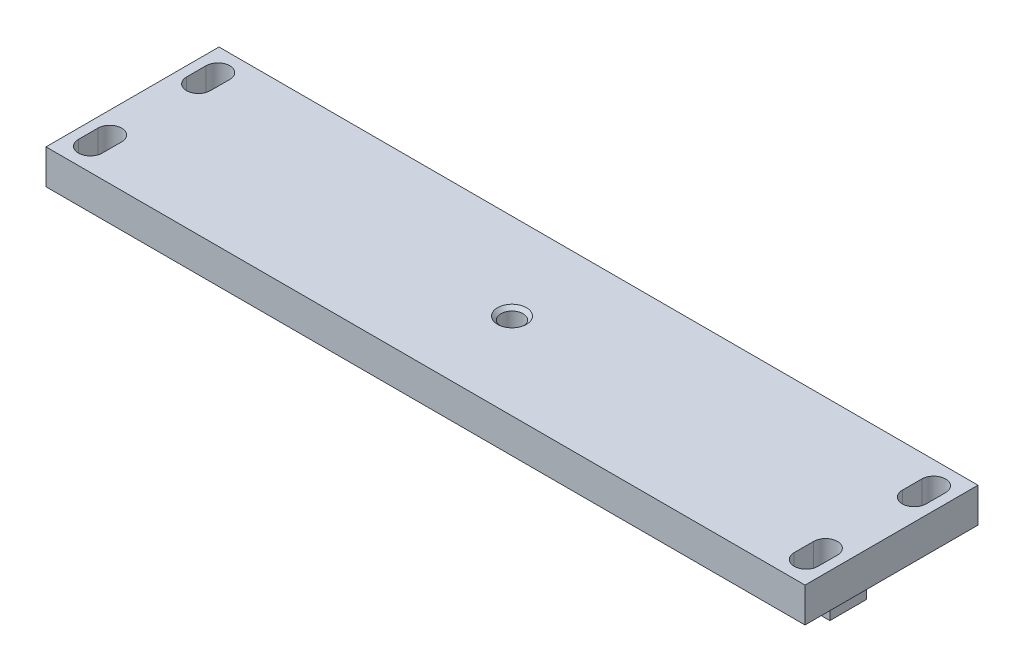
from build123d import *

# Parameters (mm, degrees)
EXTRUDE_1_DEPTH        = 351
CUT_EXTRUDE_1_DEPTH    = 356.688417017
CUT_EXTRUDE_2_DEPTH    = 364.056469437
SKETCH_4_R             = 5
CUT_EXTRUDE_3_DEPTH    = 356.688417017
HOLE_WIZARD_M121_D     = 10.2
HOLE_WIZARD_M121_DEPTH = 27
HOLE_WIZARD_M121_TIP   = 3.064389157
CHAMFER_1_SIZE         = 1.6
HOLE_WIZARD_M101_D     = 8.5
HOLE_WIZARD_M101_DEPTH = 26
HOLE_WIZARD_M101_TIP   = 2.553657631
CHAMFER_2_SIZE         = 1.5
HOLE_WIZARD_M102_D     = 8.5
HOLE_WIZARD_M102_DEPTH = 26
HOLE_WIZARD_M102_TIP   = 2.553657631
CHAMFER_3_SIZE         = 1.5
CHAMFER_4_SIZE         = 1


with BuildPart() as part:
    # Sketch 1 → Extrude 1 (new body)
    with BuildSketch(Plane(origin=(0, 0, 0), x_dir=(0, 0, -1), z_dir=(1, 0, 0))):
        Polygon((0, 0), (0, 16), (80, 16), (80, 0), (48.5, 0), (48.5, -31), (31.5, -31), (31.5, 0), align=None)
    extrude(amount=EXTRUDE_1_DEPTH)

    # Sketch 2 → Cut-Extrude 1 (cut, through all)
    with BuildSketch(Plane.XY.offset(-31.5)):
        Polygon((351, 0), (331, 0), (331, -24), (251, -24), (251, -31), (351, -31), align=None)
        Polygon((0, -31), (0, 0), (20, 0), (20, -24), (101, -24), (101, -31), align=None)
    extrude(amount=-CUT_EXTRUDE_1_DEPTH, mode=Mode.SUBTRACT)

    # Sketch 3 → Cut-Extrude 2 (cut, through all)
    with BuildSketch(Plane(origin=(0, 16, 0), x_dir=(1, 0, 0), z_dir=(0, 1, 0))):
        with BuildLine():
            Line((15.5, 69.5), (15.5, 60.5))
            ThreePointArc((15.5, 60.5), (10, 55), (4.5, 60.5))
            Line((4.5, 60.5), (4.5, 69.5))
            ThreePointArc((4.5, 69.5), (10, 75), (15.5, 69.5))
        make_face()
        with BuildLine():
            Line((15.5, 19.5), (15.5, 10.5))
            ThreePointArc((15.5, 10.5), (10, 5), (4.5, 10.5))
            Line((4.5, 10.5), (4.5, 19.5))
            ThreePointArc((4.5, 19.5), (10, 25), (15.5, 19.5))
        make_face()
        with BuildLine():
            Line((346.5, 69.5), (346.5, 60.5))
            ThreePointArc((346.5, 60.5), (341, 55), (335.5, 60.5))
            Line((335.5, 60.5), (335.5, 69.5))
            ThreePointArc((335.5, 69.5), (341, 75), (346.5, 69.5))
        make_face()
        with BuildLine():
            Line((346.5, 19.5), (346.5, 10.5))
            ThreePointArc((346.5, 10.5), (341, 5), (335.5, 10.5))
            Line((335.5, 10.5), (335.5, 19.5))
            ThreePointArc((335.5, 19.5), (341, 25), (346.5, 19.5))
        make_face()
    extrude(amount=-CUT_EXTRUDE_2_DEPTH, mode=Mode.SUBTRACT)

    # Sketch 4 → Cut-Extrude 3 (cut, through all)
    with BuildSketch(Plane.XY.offset(-31.5)):
        with Locations((221, -20)):
            Circle(SKETCH_4_R)
        with BuildLine():
            Line((128, -15), (134, -15))
            ThreePointArc((134, -15), (139, -20), (134, -25))
            Line((134, -25), (128, -25))
            ThreePointArc((128, -25), (123, -20), (128, -15))
        make_face()
    extrude(amount=-CUT_EXTRUDE_3_DEPTH, mode=Mode.SUBTRACT)

    # Hole Wizard M121
    with Locations(Plane(origin=(0, 16, 0), x_dir=(1, 0, 0), z_dir=(0, 1, 0))):
        with Locations((175.5, 40)):
            Hole(HOLE_WIZARD_M121_D / 2, depth=HOLE_WIZARD_M121_DEPTH)
            with Locations((0, 0, -(HOLE_WIZARD_M121_DEPTH + HOLE_WIZARD_M121_TIP / 2))):  # 118° drill point
                Cone(0, HOLE_WIZARD_M121_D / 2, HOLE_WIZARD_M121_TIP, mode=Mode.SUBTRACT)

    # Chamfer 1
    chamfer_1_edges = [part.edges().sort_by_distance(p)[0] for p in [
        (180.6, 16, -40),
    ]]
    chamfer(chamfer_1_edges, length=CHAMFER_1_SIZE)

    # Hole Wizard M101
    with Locations(Plane(origin=(331, 0, 0), x_dir=(0, 0, -1), z_dir=(1, 0, 0))):
        with Locations((40, -14)):
            Hole(HOLE_WIZARD_M101_D / 2, depth=HOLE_WIZARD_M101_DEPTH)
            with Locations((0, 0, -(HOLE_WIZARD_M101_DEPTH + HOLE_WIZARD_M101_TIP / 2))):  # 118° drill point
                Cone(0, HOLE_WIZARD_M101_D / 2, HOLE_WIZARD_M101_TIP, mode=Mode.SUBTRACT)

    # Chamfer 2
    chamfer_2_edges = [part.edges().sort_by_distance(p)[0] for p in [
        (331, -14, -44.25),
    ]]
    chamfer(chamfer_2_edges, length=CHAMFER_2_SIZE)

    # Hole Wizard M102
    with Locations(Plane.ZY.offset(-20)):
        with Locations((-40, -14)):
            Hole(HOLE_WIZARD_M102_D / 2, depth=HOLE_WIZARD_M102_DEPTH)
            with Locations((0, 0, -(HOLE_WIZARD_M102_DEPTH + HOLE_WIZARD_M102_TIP / 2))):  # 118° drill point
                Cone(0, HOLE_WIZARD_M102_D / 2, HOLE_WIZARD_M102_TIP, mode=Mode.SUBTRACT)

    # Chamfer 3
    chamfer_3_edges = [part.edges().sort_by_distance(p)[0] for p in [
        (20, -14, -35.75),
    ]]
    chamfer(chamfer_3_edges, length=CHAMFER_3_SIZE)

    # Chamfer 4
    chamfer_4_edges = [part.edges().sort_by_distance(p)[0] for p in [
        (131, -25, -48.5),
        (139, -20, -48.5),
        (131, -15, -48.5),
        (123, -20, -48.5),
        (216, -20, -48.5),
        (216, -20, -31.5),
        (123, -20, -31.5),
        (131, -25, -31.5),
        (139, -20, -31.5),
        (131, -15, -31.5),
    ]]
    chamfer(chamfer_4_edges, length=CHAMFER_4_SIZE)


solid = part.part
